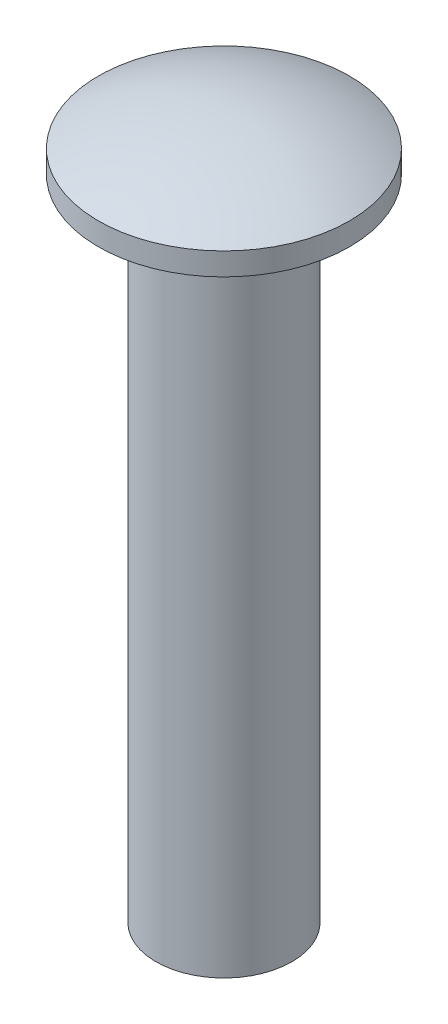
from build123d import *


with BuildPart() as part:
    # Sketch1 → Revolve1 (revolve)
    with BuildSketch(Plane.XY):
        with BuildLine():
            Line((2.7686, 14.2875), (1.4986, 14.2875))
            Line((1.4986, 14.2875), (1.4986, 0))
            Line((1.4986, 0), (1.0795, 0))
            Line((1.0795, 0), (1.0795, 1.212585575))
            Line((1.0795, 1.212585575), (0, 1.659729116))
            Line((0, 1.659729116), (0, 15.4875))
            ThreePointArc((0, 15.4875), (1.42833097, 15.30878887), (2.7686, 14.783673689))
            Line((2.7686, 14.783673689), (2.7686, 14.2875))
        make_face()
    revolve(axis=Axis((0, 1.659729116, 0), (0, 1, 0)))


solid = part.part
